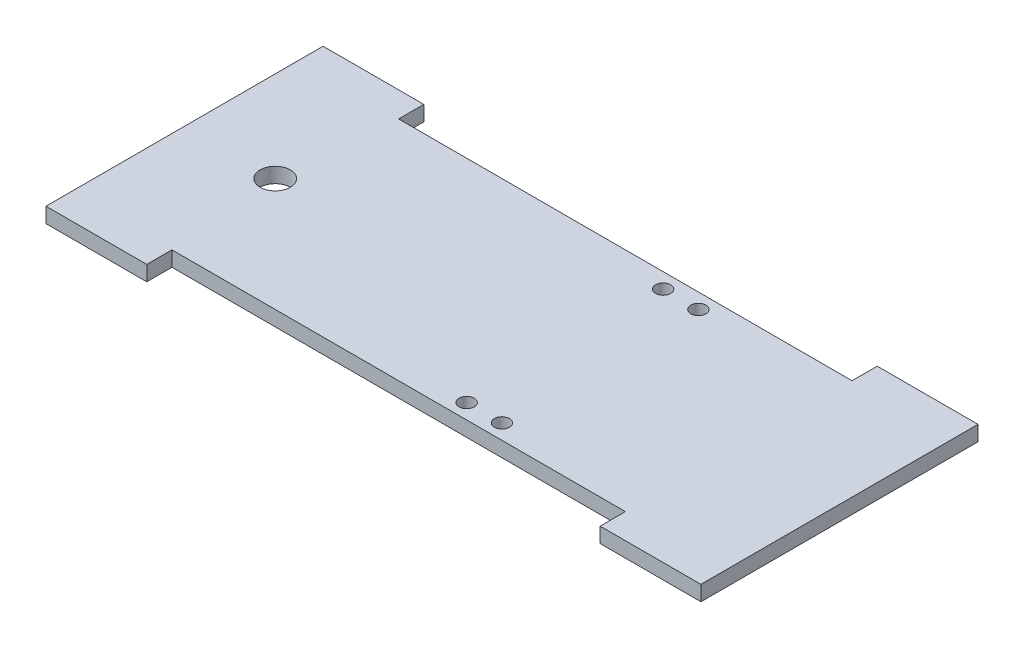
from build123d import *

# Parameters (mm, degrees)
ESQUISSE1_W                = 130
ESQUISSE1_H                = 3
EXTRUSION1_DEPTH           = 55
ESQUISSE2_W                = 90
ESQUISSE2_H                = 11.157348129
ESQUISSE2_H_2              = 21.899630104
ENL_V_MAT_EXTRU_1_DEPTH    = 10
ESQUISSE3_R                = 3
ENL_V_MAT_EXTRU_2_DEPTH    = 103.206477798
ESQUISSE4_R                = 1.5
ENL_V_MAT_EXTRU_3_DEPTH    = 103.206477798
R_P_TITION_LIN_AIRE1_COUNT = 2
R_P_TITION_LIN_AIRE1_PITCH = 7


with BuildPart() as part:
    # Esquisse1 → Extrusion1 (new body)
    with BuildSketch(Plane.XY):
        with Locations((-21.093926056, 1.920950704)):
            Rectangle(ESQUISSE1_W, ESQUISSE1_H)
    extrude(amount=EXTRUSION1_DEPTH)

    # Esquisse2 → Enl_v. mat.-Extru.1 (cut)
    with BuildSketch(Plane(origin=(0, 3.420950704, 0), x_dir=(-1, 0, 0), z_dir=(0, 1, 0))):
        with Locations((21.093926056, -0.578674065)):
            Rectangle(ESQUISSE2_W, ESQUISSE2_H)
        with Locations((21.093926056, 60.949815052)):
            Rectangle(ESQUISSE2_W, ESQUISSE2_H_2)
    extrude(amount=-ENL_V_MAT_EXTRU_1_DEPTH, mode=Mode.SUBTRACT)

    # Esquisse3 → Enl_v. mat.-Extru.2 (cut, through all)
    with BuildSketch(Plane(origin=(0, 3.420950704, 0), x_dir=(-1, 0, 0), z_dir=(0, 1, 0))):
        with Locations(Location((68.093926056, 27.5, 0), (0, 0, 90))):
            Circle(ESQUISSE3_R)
    extrude(amount=-ENL_V_MAT_EXTRU_2_DEPTH, mode=Mode.SUBTRACT)

    # Esquisse4 → Enl_v. mat.-Extru.3 (cut, through all)
    with BuildSketch(Plane(origin=(0, 3.420950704, 0), x_dir=(-1, 0, 0), z_dir=(0, 1, 0))):
        with Locations(Location((3.593926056, 8, 0), (0, 0, 90))):
            Circle(ESQUISSE4_R)
        with Locations(Location((3.593926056, 47, 0), (0, 0, 90))):
            Circle(ESQUISSE4_R)
    enl_v_mat_extru_3 = extrude(amount=-ENL_V_MAT_EXTRU_3_DEPTH, mode=Mode.SUBTRACT)

    # R_p_tition lin_aire1: Enl_v. mat.-Extru.3 ×2
    with Locations(*[(-i * R_P_TITION_LIN_AIRE1_PITCH, 0, 0) for i in range(1, R_P_TITION_LIN_AIRE1_COUNT)]):
        add(enl_v_mat_extru_3, mode=Mode.SUBTRACT)


solid = part.part
